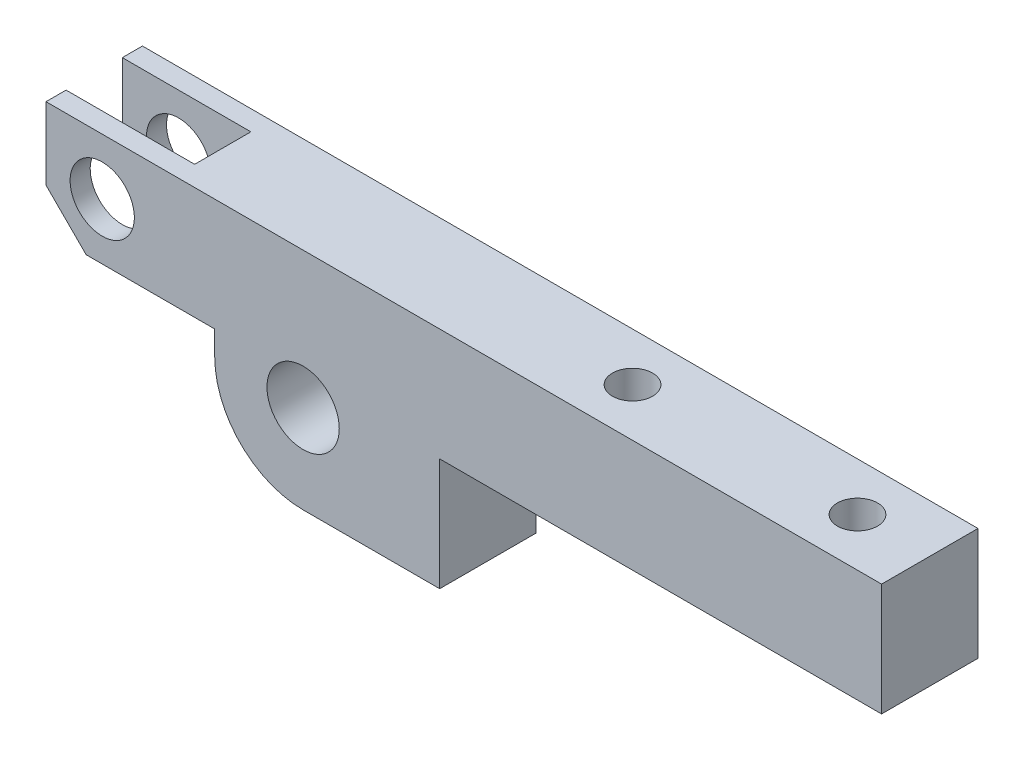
from build123d import *

# Parameters (mm, degrees)
ESQUISSE1_R             = 4.5
BASE_EXTRUSION_DEPTH    = 12
ESQUISSE2_W             = 7
ESQUISSE2_H             = 14
ENL_V_MAT_EXTRU_1_DEPTH = 16
CHANFREIN1_SIZE         = 5
ESQUISSE3_R             = 4
ENL_V_MAT_EXTRU_2_DEPTH = 12
ESQUISSE4_R             = 2.5
ENL_V_MAT_EXTRU_3_DEPTH = 15


with BuildPart() as part:
    # Esquisse1 → Base-Extrusion (new body)
    with BuildSketch(Plane.XY):
        with BuildLine():
            Line((-80, 40), (-80, 26))
            Line((-80, 26), (-59, 26))
            Line((-59, 26), (-59, 23))
            ThreePointArc((-59, 23), (-55.778174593, 15.221825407), (-48, 12))
            Line((-48, 12), (-31, 12))
            Line((-31, 12), (-31, 26))
            Line((-31, 26), (24, 26))
            Line((24, 26), (24, 40))
            Line((24, 40), (-80, 40))
        make_face()
        with Locations((-48, 23)):
            Circle(ESQUISSE1_R, mode=Mode.SUBTRACT)
    extrude(amount=BASE_EXTRUSION_DEPTH)

    # Esquisse2 → Enl_v. mat.-Extru.1 (cut)
    with BuildSketch(Plane.ZY.offset(80)):
        with Locations((6, 33)):
            Rectangle(ESQUISSE2_W, ESQUISSE2_H)
    extrude(amount=-ENL_V_MAT_EXTRU_1_DEPTH, mode=Mode.SUBTRACT)

    # Chanfrein1
    chanfrein1_edges = [part.edges().sort_by_distance(p)[0] for p in [
        (-80, 26, 1.25),
        (-80, 26, 10.75),
    ]]
    chamfer(chanfrein1_edges, length=CHANFREIN1_SIZE)

    # Esquisse3 → Enl_v. mat.-Extru.2 (cut)
    with BuildSketch(Plane.XY.offset(12)):
        with Locations((-73, 33)):
            Circle(ESQUISSE3_R)
    extrude(amount=-ENL_V_MAT_EXTRU_2_DEPTH, mode=Mode.SUBTRACT)

    # Esquisse4 → Enl_v. mat.-Extru.3 (cut)
    with BuildSketch(Plane(origin=(0, 40, 0), x_dir=(-1, 0, 0), z_dir=(0, 1, 0))):
        with Locations((-15, 6)):
            Circle(ESQUISSE4_R)
        with Locations((13, 6)):
            Circle(ESQUISSE4_R)
    extrude(amount=-ENL_V_MAT_EXTRU_3_DEPTH, mode=Mode.SUBTRACT)


solid = part.part
